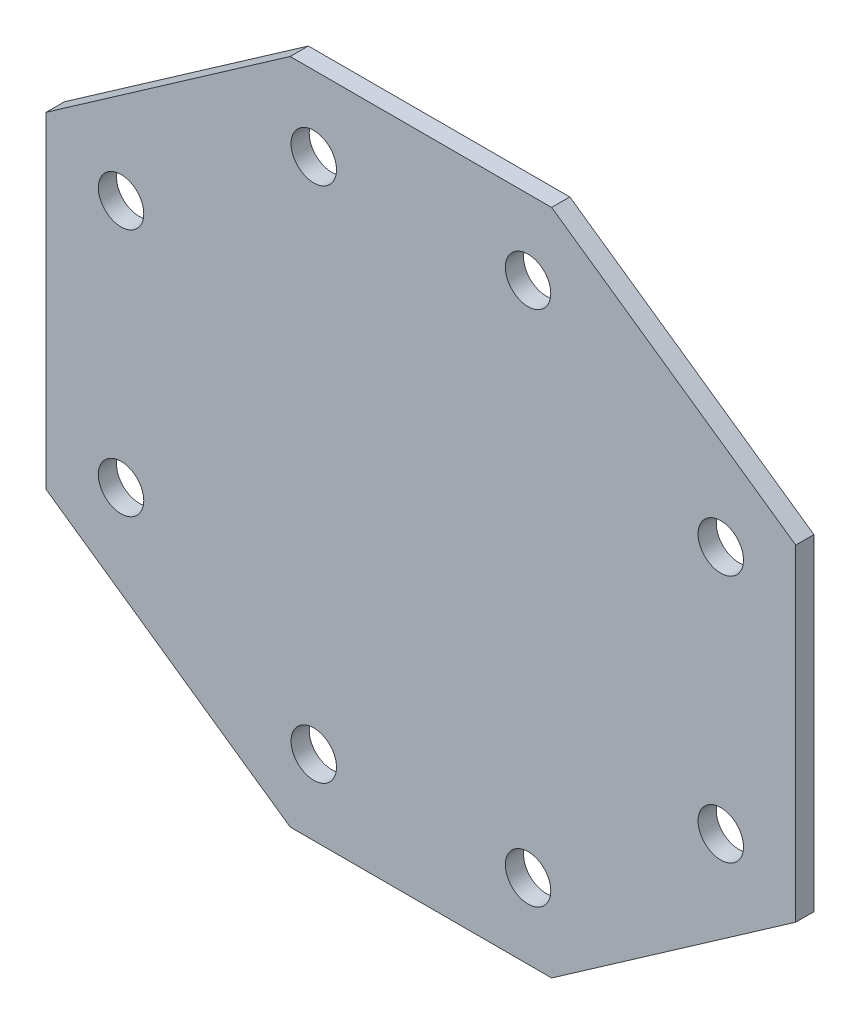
from build123d import *

# Parameters (mm, degrees)
MAIN_PLATE_DEPTH        = 25.4
CUT_EXTRUDE1_DEPTH      = 702.803266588
CUT_EXTRUDE1_DEPTH_BACK = 702.803266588
SKETCH5_R               = 31.75


with BuildPart() as part:
    # Sketch3 → Main Plate (new body)
    with BuildSketch(Plane(origin=(0, 0, 0), x_dir=(0, 1, 0), z_dir=(0, 0, 1))):
        Polygon((228.234235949, 523.855268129), (466.324268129, 182.70492307), (466.324268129, -182.70492307), (228.234235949, -523.855268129), (-228.234235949, -523.855268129), (-466.324268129, -182.70492307), (-466.324268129, 182.70492307), (-228.234235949, 523.855268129), align=None)
    extrude(amount=MAIN_PLATE_DEPTH)

    # Sketch5 → Cut-Extrude1 (cut, two sides: drawn at the far end of the back side and taken through both)
    with BuildSketch(Plane(origin=(0, 0, 0), x_dir=(0, 1, 0), z_dir=(0, 0, 1)).offset(-CUT_EXTRUDE1_DEPTH_BACK)):
        with Locations(Location((-173.588730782, 419.080268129, 0), (0, 0, 270))):
            Circle(SKETCH5_R)
        with Locations(Location((173.588730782, 419.080268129, 0), (0, 0, 270))):
            Circle(SKETCH5_R)
        with Locations(Location((361.549268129, 149.758610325, 0), (0, 0, 270))):
            Circle(SKETCH5_R)
        with Locations(Location((361.549268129, -149.758610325, 0), (0, 0, 270))):
            Circle(SKETCH5_R)
        with Locations(Location((173.588730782, -419.080268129, 0), (0, 0, 270))):
            Circle(SKETCH5_R)
        with Locations(Location((-173.588730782, -419.080268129, 0), (0, 0, 270))):
            Circle(SKETCH5_R)
        with Locations(Location((-361.549268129, -149.758610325, 0), (0, 0, 270))):
            Circle(SKETCH5_R)
        with Locations(Location((-361.549268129, 149.758610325, 0), (0, 0, 270))):
            Circle(SKETCH5_R)
    extrude(amount=CUT_EXTRUDE1_DEPTH + CUT_EXTRUDE1_DEPTH_BACK, mode=Mode.SUBTRACT)


solid = part.part
